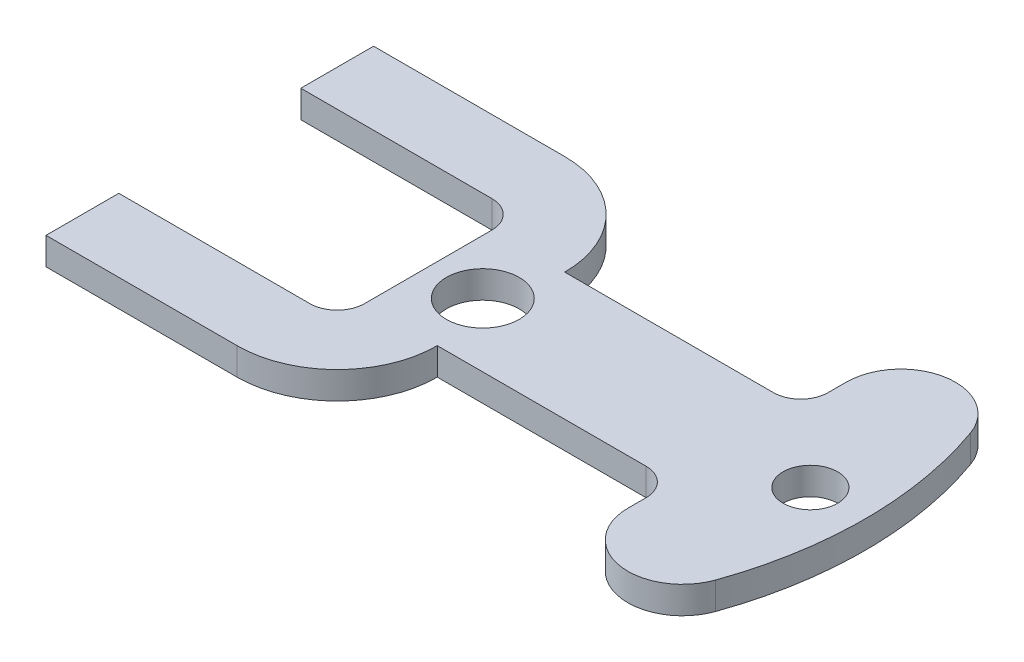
from build123d import *

# Parameters (mm, degrees)
SKETCH1_R      = 4
SKETCH1_R_2    = 3
EXTRUDE1_DEPTH = 3


with BuildPart() as part:
    # Sketch1 → Extrude1 (new body)
    with BuildSketch(Plane(origin=(0, 0, 0), x_dir=(1, 0, 0), z_dir=(0, 1, 0))):
        with BuildLine():
            Line((2, -7), (24.941125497, -7))
            ThreePointArc((24.941125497, -7), (27.062445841, -7.878679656), (27.941125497, -10))
            Line((27.941125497, -10), (27.941125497, -12))
            ThreePointArc((27.941125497, -12), (32.926513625, -17.913591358), (39.597979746, -14))
            ThreePointArc((39.597979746, -14), (42, 0), (39.597979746, 14))
            ThreePointArc((39.597979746, 14), (32.926513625, 17.913591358), (27.941125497, 12))
            Line((27.941125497, 12), (27.941125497, 10))
            ThreePointArc((27.941125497, 10), (27.062445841, 7.878679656), (24.941125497, 7))
            Line((24.941125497, 7), (2, 7))
            ThreePointArc((2, 7), (-1.221825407, 14.778174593), (-9, 18))
            Line((-9, 18), (-30, 18))
            Line((-30, 18), (-30, 10))
            Line((-30, 10), (-9, 10))
            ThreePointArc((-9, 10), (-6.878679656, 9.121320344), (-6, 7))
            Line((-6, 7), (-6, -7))
            ThreePointArc((-6, -7), (-6.878679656, -9.121320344), (-9, -10))
            Line((-9, -10), (-30, -10))
            Line((-30, -10), (-30, -18))
            Line((-30, -18), (-9, -18))
            ThreePointArc((-9, -18), (-1.221825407, -14.778174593), (2, -7))
        make_face()
        with Locations(Location((0, 0, 0), (0, 0, 270))):
            Circle(SKETCH1_R, mode=Mode.SUBTRACT)
        with Locations(Location((36, 0, 0), (0, 0, 270))):
            Circle(SKETCH1_R_2, mode=Mode.SUBTRACT)
    extrude(amount=EXTRUDE1_DEPTH)


solid = part.part
